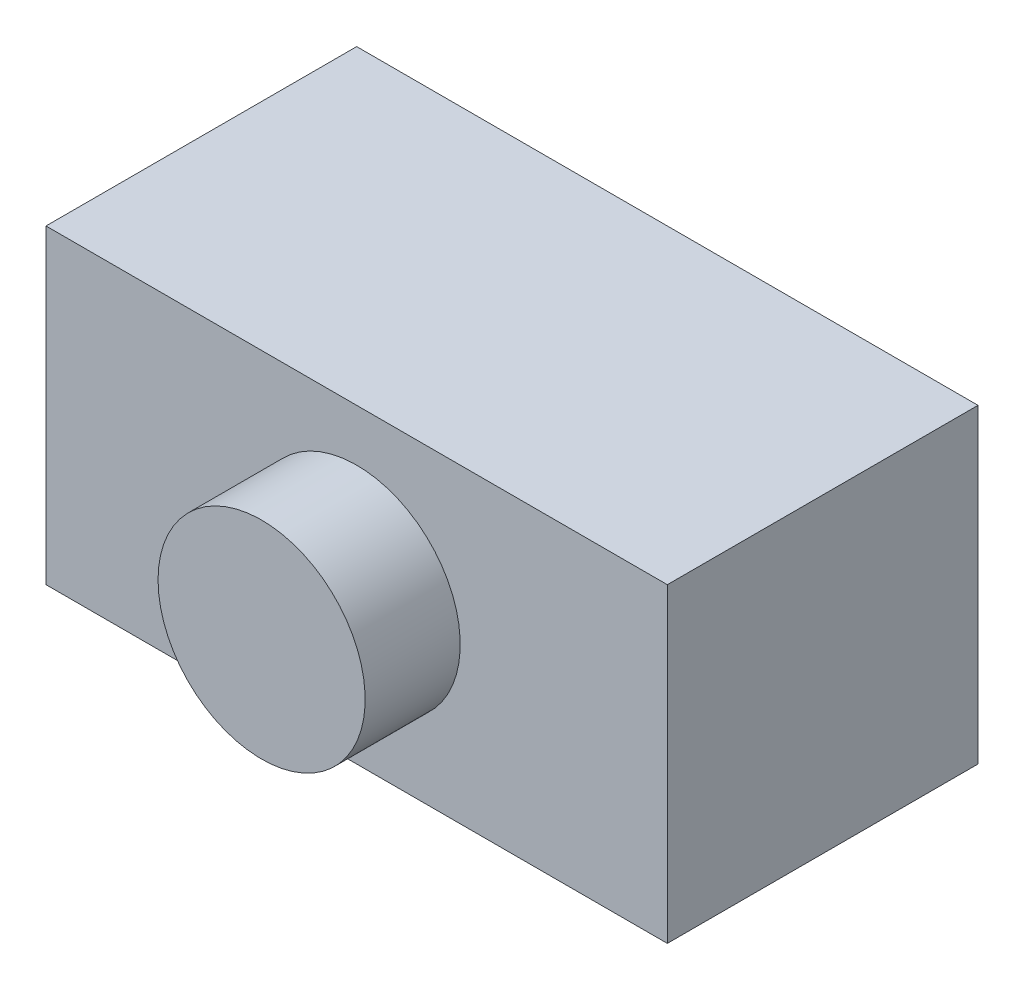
ISO-10303-21;
HEADER;
FILE_DESCRIPTION(('STEP AP214'),'2;1');
FILE_NAME('part.step','',(''),(''),'','','');
FILE_SCHEMA(('AUTOMOTIVE_DESIGN { 1 0 10303 214 1 1 1 1 }'));
ENDSEC;
DATA;
#1=APPLICATION_CONTEXT('core data for automotive mechanical design processes');
#2=APPLICATION_PROTOCOL_DEFINITION('international standard','automotive_design',2000,#1);
#3=PRODUCT_CONTEXT('',#1,'mechanical');
#4=PRODUCT('Part','Part','',(#3));
#5=PRODUCT_RELATED_PRODUCT_CATEGORY('part','',(#4));
#6=PRODUCT_DEFINITION_FORMATION('','',#4);
#7=PRODUCT_DEFINITION_CONTEXT('part definition',#1,'design');
#8=PRODUCT_DEFINITION('design','',#6,#7);
#9=PRODUCT_DEFINITION_SHAPE('','',#8);
#10=(LENGTH_UNIT() NAMED_UNIT(*) SI_UNIT(.MILLI.,.METRE.));
#11=(NAMED_UNIT(*) PLANE_ANGLE_UNIT() SI_UNIT($,.RADIAN.));
#12=(NAMED_UNIT(*) SI_UNIT($,.STERADIAN.) SOLID_ANGLE_UNIT());
#13=UNCERTAINTY_MEASURE_WITH_UNIT(LENGTH_MEASURE(1.E-05),#10,'distance_accuracy_value','');
#14=(GEOMETRIC_REPRESENTATION_CONTEXT(3) GLOBAL_UNCERTAINTY_ASSIGNED_CONTEXT((#13)) GLOBAL_UNIT_ASSIGNED_CONTEXT((#10,
#11,#12)) REPRESENTATION_CONTEXT('',''));
#15=CARTESIAN_POINT('',(0.,0.,0.));
#16=DIRECTION('',(0.,0.,1.));
#17=DIRECTION('',(1.,0.,0.));
#18=AXIS2_PLACEMENT_3D('',#15,#16,#17);
#19=CARTESIAN_POINT('',(0.,0.,5.8293));
#20=DIRECTION('',(0.,0.,-1.));
#21=DIRECTION('',(-1.,0.,0.));
#22=AXIS2_PLACEMENT_3D('',#19,#20,#21);
#23=CYLINDRICAL_SURFACE('',#22,12.7);
#24=CARTESIAN_POINT('',(0.,0.,5.8293));
#25=DIRECTION('',(0.,0.,1.));
#26=DIRECTION('',(1.,0.,0.));
#27=AXIS2_PLACEMENT_3D('',#24,#25,#26);
#28=CIRCLE('',#27,12.7);
#29=CARTESIAN_POINT('',(-12.7,0.,5.8293));
#30=VERTEX_POINT('',#29);
#31=EDGE_CURVE('E11',#30,#30,#28,.T.);
#32=CARTESIAN_POINT('',(0.,0.,-5.8293));
#33=DIRECTION('',(0.,0.,-1.));
#34=DIRECTION('',(-1.,0.,0.));
#35=AXIS2_PLACEMENT_3D('',#32,#33,#34);
#36=CIRCLE('',#35,12.7);
#37=CARTESIAN_POINT('',(-12.7,0.,-5.8293));
#38=VERTEX_POINT('',#37);
#39=EDGE_CURVE('E47',#38,#38,#36,.T.);
#40=CARTESIAN_POINT('',(-12.7,0.,5.8293));
#41=CARTESIAN_POINT('',(-12.7,0.,5.70785625));
#42=CARTESIAN_POINT('',(-12.7,0.,5.5864125));
#43=CARTESIAN_POINT('',(-12.7,0.,5.343525));
#44=CARTESIAN_POINT('',(-12.7,0.,5.22208125));
#45=CARTESIAN_POINT('',(-12.7,0.,4.97919375));
#46=CARTESIAN_POINT('',(-12.7,0.,4.85775));
#47=CARTESIAN_POINT('',(-12.7,0.,4.6148625));
#48=CARTESIAN_POINT('',(-12.7,0.,4.49341875));
#49=CARTESIAN_POINT('',(-12.7,0.,4.25053125));
#50=CARTESIAN_POINT('',(-12.7,0.,4.1290875));
#51=CARTESIAN_POINT('',(-12.7,0.,3.8862));
#52=CARTESIAN_POINT('',(-12.7,0.,3.76475625));
#53=CARTESIAN_POINT('',(-12.7,0.,3.52186875));
#54=CARTESIAN_POINT('',(-12.7,0.,3.400425));
#55=CARTESIAN_POINT('',(-12.7,0.,3.1575375));
#56=CARTESIAN_POINT('',(-12.7,0.,3.03609375));
#57=CARTESIAN_POINT('',(-12.7,0.,2.79320625));
#58=CARTESIAN_POINT('',(-12.7,0.,2.6717625));
#59=CARTESIAN_POINT('',(-12.7,0.,2.428875));
#60=CARTESIAN_POINT('',(-12.7,0.,2.30743125));
#61=CARTESIAN_POINT('',(-12.7,0.,2.06454375));
#62=CARTESIAN_POINT('',(-12.7,0.,1.9431));
#63=CARTESIAN_POINT('',(-12.7,0.,1.7002125));
#64=CARTESIAN_POINT('',(-12.7,0.,1.57876875));
#65=CARTESIAN_POINT('',(-12.7,0.,1.33588125));
#66=CARTESIAN_POINT('',(-12.7,0.,1.2144375));
#67=CARTESIAN_POINT('',(-12.7,0.,0.971549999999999));
#68=CARTESIAN_POINT('',(-12.7,0.,0.850106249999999));
#69=CARTESIAN_POINT('',(-12.7,0.,0.607218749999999));
#70=CARTESIAN_POINT('',(-12.7,0.,0.485774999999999));
#71=CARTESIAN_POINT('',(-12.7,0.,0.242887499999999));
#72=CARTESIAN_POINT('',(-12.7,0.,0.121443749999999));
#73=CARTESIAN_POINT('',(-12.7,0.,-0.121443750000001));
#74=CARTESIAN_POINT('',(-12.7,0.,-0.242887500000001));
#75=CARTESIAN_POINT('',(-12.7,0.,-0.485775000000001));
#76=CARTESIAN_POINT('',(-12.7,0.,-0.607218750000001));
#77=CARTESIAN_POINT('',(-12.7,0.,-0.850106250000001));
#78=CARTESIAN_POINT('',(-12.7,0.,-0.971550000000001));
#79=CARTESIAN_POINT('',(-12.7,0.,-1.2144375));
#80=CARTESIAN_POINT('',(-12.7,0.,-1.33588125));
#81=CARTESIAN_POINT('',(-12.7,0.,-1.57876875));
#82=CARTESIAN_POINT('',(-12.7,0.,-1.7002125));
#83=CARTESIAN_POINT('',(-12.7,0.,-1.9431));
#84=CARTESIAN_POINT('',(-12.7,0.,-2.06454375));
#85=CARTESIAN_POINT('',(-12.7,0.,-2.30743125));
#86=CARTESIAN_POINT('',(-12.7,0.,-2.428875));
#87=CARTESIAN_POINT('',(-12.7,0.,-2.6717625));
#88=CARTESIAN_POINT('',(-12.7,0.,-2.79320625));
#89=CARTESIAN_POINT('',(-12.7,0.,-3.03609375));
#90=CARTESIAN_POINT('',(-12.7,0.,-3.1575375));
#91=CARTESIAN_POINT('',(-12.7,0.,-3.400425));
#92=CARTESIAN_POINT('',(-12.7,0.,-3.52186875));
#93=CARTESIAN_POINT('',(-12.7,0.,-3.76475625));
#94=CARTESIAN_POINT('',(-12.7,0.,-3.8862));
#95=CARTESIAN_POINT('',(-12.7,0.,-4.1290875));
#96=CARTESIAN_POINT('',(-12.7,0.,-4.25053125));
#97=CARTESIAN_POINT('',(-12.7,0.,-4.49341875));
#98=CARTESIAN_POINT('',(-12.7,0.,-4.6148625));
#99=CARTESIAN_POINT('',(-12.7,0.,-4.85775));
#100=CARTESIAN_POINT('',(-12.7,0.,-4.97919375));
#101=CARTESIAN_POINT('',(-12.7,0.,-5.22208125));
#102=CARTESIAN_POINT('',(-12.7,0.,-5.343525));
#103=CARTESIAN_POINT('',(-12.7,0.,-5.5864125));
#104=CARTESIAN_POINT('',(-12.7,0.,-5.70785625));
#105=CARTESIAN_POINT('',(-12.7,0.,-5.8293));
#106=B_SPLINE_CURVE_WITH_KNOTS('',3,(#40,#41,#42,#43,#44,#45,#46,#47,#48,#49,#50,#51,#52,#53,
#54,#55,#56,#57,#58,#59,#60,#61,#62,#63,#64,#65,#66,#67,#68,#69,#70,#71,#72,#73,#74,#75,#76,#77,
#78,#79,#80,#81,#82,#83,#84,#85,#86,#87,#88,#89,#90,#91,#92,#93,#94,#95,#96,#97,#98,#99,#100,
#101,#102,#103,#104,#105),.UNSPECIFIED.,.F.,.F.,(4,2,2,2,2,2,2,2,2,2,2,2,2,2,2,2,2,2,2,2,2,2,2,
2,2,2,2,2,2,2,2,2,4),(0.,0.36433125,0.728662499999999,1.09299375,1.457325,1.82165625,2.1859875,
2.55031875,2.91465,3.27898125,3.6433125,4.00764375,4.371975,4.73630625,5.1006375,5.46496875,
5.8293,6.19363125,6.5579625,6.92229375,7.286625,7.65095625,8.0152875,8.37961875,8.74395,
9.10828125,9.4726125,9.83694375,10.201275,10.56560625,10.9299375,11.29426875,11.6586),.UNSPECIFIED.);
#107=EDGE_CURVE('BSEAM41',#30,#38,#106,.T.);
#108=ORIENTED_EDGE('',*,*,#31,.F.);
#109=ORIENTED_EDGE('',*,*,#39,.F.);
#110=ORIENTED_EDGE('',*,*,#107,.T.);
#111=ORIENTED_EDGE('',*,*,#107,.F.);
#112=EDGE_LOOP('',(#108,#110,#109,#111));
#113=FACE_BOUND('',#112,.T.);
#114=ADVANCED_FACE('F41',(#113),#23,.T.);
#115=CARTESIAN_POINT('',(0.,0.,5.8293));
#116=DIRECTION('',(0.,0.,1.));
#117=DIRECTION('',(1.,0.,0.));
#118=AXIS2_PLACEMENT_3D('',#115,#116,#117);
#119=PLANE('',#118);
#120=ORIENTED_EDGE('',*,*,#31,.T.);
#121=EDGE_LOOP('',(#120));
#122=FACE_BOUND('',#121,.T.);
#123=ADVANCED_FACE('F124',(#122),#119,.T.);
#124=CARTESIAN_POINT('',(-38.1,19.05,-5.8293));
#125=DIRECTION('',(0.,0.,-1.));
#126=DIRECTION('',(-1.,0.,0.));
#127=AXIS2_PLACEMENT_3D('',#124,#125,#126);
#128=PLANE('',#127);
#129=DIRECTION('',(0.,1.,0.));
#130=VECTOR('',#129,1.);
#131=CARTESIAN_POINT('',(-38.1,-19.05,-5.8293));
#132=LINE('',#131,#130);
#133=CARTESIAN_POINT('',(-38.1,-19.05,-5.8293));
#134=VERTEX_POINT('',#133);
#135=CARTESIAN_POINT('',(-38.1,19.05,-5.8293));
#136=VERTEX_POINT('',#135);
#137=EDGE_CURVE('E107',#134,#136,#132,.T.);
#138=ORIENTED_EDGE('',*,*,#137,.F.);
#139=DIRECTION('',(-1.,0.,0.));
#140=VECTOR('',#139,1.);
#141=CARTESIAN_POINT('',(-38.1,-19.05,-5.8293));
#142=LINE('',#141,#140);
#143=CARTESIAN_POINT('',(38.1,-19.05,-5.8293));
#144=VERTEX_POINT('',#143);
#145=EDGE_CURVE('E76',#144,#134,#142,.T.);
#146=ORIENTED_EDGE('',*,*,#145,.F.);
#147=DIRECTION('',(0.,-1.,0.));
#148=VECTOR('',#147,1.);
#149=CARTESIAN_POINT('',(38.1,-19.05,-5.8293));
#150=LINE('',#149,#148);
#151=CARTESIAN_POINT('',(38.1,19.05,-5.8293));
#152=VERTEX_POINT('',#151);
#153=EDGE_CURVE('E74',#152,#144,#150,.T.);
#154=ORIENTED_EDGE('',*,*,#153,.F.);
#155=DIRECTION('',(1.,0.,0.));
#156=VECTOR('',#155,1.);
#157=CARTESIAN_POINT('',(-38.1,19.05,-5.8293));
#158=LINE('',#157,#156);
#159=EDGE_CURVE('E98',#136,#152,#158,.T.);
#160=ORIENTED_EDGE('',*,*,#159,.F.);
#161=EDGE_LOOP('',(#138,#146,#154,#160));
#162=FACE_BOUND('',#161,.T.);
#163=ORIENTED_EDGE('',*,*,#39,.T.);
#164=EDGE_LOOP('',(#163));
#165=FACE_BOUND('',#164,.T.);
#166=ADVANCED_FACE('F118',(#162,#165),#128,.F.);
#167=CARTESIAN_POINT('',(-38.1,-19.05,-43.9293));
#168=DIRECTION('',(1.,0.,0.));
#169=DIRECTION('',(0.,0.,-1.));
#170=AXIS2_PLACEMENT_3D('',#167,#168,#169);
#171=PLANE('',#170);
#172=ORIENTED_EDGE('',*,*,#137,.T.);
#173=DIRECTION('',(0.,0.,1.));
#174=VECTOR('',#173,1.);
#175=CARTESIAN_POINT('',(-38.1,19.05,-43.9293));
#176=LINE('',#175,#174);
#177=CARTESIAN_POINT('',(-38.1,19.05,-43.9293));
#178=VERTEX_POINT('',#177);
#179=EDGE_CURVE('E97',#178,#136,#176,.T.);
#180=ORIENTED_EDGE('',*,*,#179,.F.);
#181=DIRECTION('',(0.,1.,0.));
#182=VECTOR('',#181,1.);
#183=CARTESIAN_POINT('',(-38.1,-19.05,-43.9293));
#184=LINE('',#183,#182);
#185=CARTESIAN_POINT('',(-38.1,-19.05,-43.9293));
#186=VERTEX_POINT('',#185);
#187=EDGE_CURVE('E91',#186,#178,#184,.T.);
#188=ORIENTED_EDGE('',*,*,#187,.F.);
#189=DIRECTION('',(0.,0.,1.));
#190=VECTOR('',#189,1.);
#191=CARTESIAN_POINT('',(-38.1,-19.05,-43.9293));
#192=LINE('',#191,#190);
#193=EDGE_CURVE('E102',#186,#134,#192,.T.);
#194=ORIENTED_EDGE('',*,*,#193,.T.);
#195=EDGE_LOOP('',(#172,#180,#188,#194));
#196=FACE_BOUND('',#195,.T.);
#197=ADVANCED_FACE('F134',(#196),#171,.F.);
#198=CARTESIAN_POINT('',(-38.1,19.05,-43.9293));
#199=DIRECTION('',(0.,-1.,0.));
#200=DIRECTION('',(1.,0.,0.));
#201=AXIS2_PLACEMENT_3D('',#198,#199,#200);
#202=PLANE('',#201);
#203=ORIENTED_EDGE('',*,*,#159,.T.);
#204=DIRECTION('',(0.,0.,1.));
#205=VECTOR('',#204,1.);
#206=CARTESIAN_POINT('',(38.1,19.05,-43.9293));
#207=LINE('',#206,#205);
#208=CARTESIAN_POINT('',(38.1,19.05,-43.9293));
#209=VERTEX_POINT('',#208);
#210=EDGE_CURVE('E96',#209,#152,#207,.T.);
#211=ORIENTED_EDGE('',*,*,#210,.F.);
#212=DIRECTION('',(1.,0.,0.));
#213=VECTOR('',#212,1.);
#214=CARTESIAN_POINT('',(-38.1,19.05,-43.9293));
#215=LINE('',#214,#213);
#216=EDGE_CURVE('E86',#178,#209,#215,.T.);
#217=ORIENTED_EDGE('',*,*,#216,.F.);
#218=ORIENTED_EDGE('',*,*,#179,.T.);
#219=EDGE_LOOP('',(#203,#211,#217,#218));
#220=FACE_BOUND('',#219,.T.);
#221=ADVANCED_FACE('F100',(#220),#202,.F.);
#222=CARTESIAN_POINT('',(38.1,-19.05,-43.9293));
#223=DIRECTION('',(-1.,0.,0.));
#224=DIRECTION('',(0.,0.,1.));
#225=AXIS2_PLACEMENT_3D('',#222,#223,#224);
#226=PLANE('',#225);
#227=ORIENTED_EDGE('',*,*,#153,.T.);
#228=DIRECTION('',(0.,0.,1.));
#229=VECTOR('',#228,1.);
#230=CARTESIAN_POINT('',(38.1,-19.05,-43.9293));
#231=LINE('',#230,#229);
#232=CARTESIAN_POINT('',(38.1,-19.05,-43.9293));
#233=VERTEX_POINT('',#232);
#234=EDGE_CURVE('E99',#233,#144,#231,.T.);
#235=ORIENTED_EDGE('',*,*,#234,.F.);
#236=DIRECTION('',(0.,-1.,0.));
#237=VECTOR('',#236,1.);
#238=CARTESIAN_POINT('',(38.1,-19.05,-43.9293));
#239=LINE('',#238,#237);
#240=EDGE_CURVE('E93',#209,#233,#239,.T.);
#241=ORIENTED_EDGE('',*,*,#240,.F.);
#242=ORIENTED_EDGE('',*,*,#210,.T.);
#243=EDGE_LOOP('',(#227,#235,#241,#242));
#244=FACE_BOUND('',#243,.T.);
#245=ADVANCED_FACE('F105',(#244),#226,.F.);
#246=CARTESIAN_POINT('',(-38.1,-19.05,-43.9293));
#247=DIRECTION('',(0.,1.,0.));
#248=DIRECTION('',(-1.,0.,0.));
#249=AXIS2_PLACEMENT_3D('',#246,#247,#248);
#250=PLANE('',#249);
#251=ORIENTED_EDGE('',*,*,#145,.T.);
#252=ORIENTED_EDGE('',*,*,#193,.F.);
#253=DIRECTION('',(-1.,0.,0.));
#254=VECTOR('',#253,1.);
#255=CARTESIAN_POINT('',(-38.1,-19.05,-43.9293));
#256=LINE('',#255,#254);
#257=EDGE_CURVE('E60',#233,#186,#256,.T.);
#258=ORIENTED_EDGE('',*,*,#257,.F.);
#259=ORIENTED_EDGE('',*,*,#234,.T.);
#260=EDGE_LOOP('',(#251,#252,#258,#259));
#261=FACE_BOUND('',#260,.T.);
#262=ADVANCED_FACE('F141',(#261),#250,.F.);
#263=CARTESIAN_POINT('',(-38.1,19.05,-43.9293));
#264=DIRECTION('',(0.,0.,-1.));
#265=DIRECTION('',(-1.,0.,0.));
#266=AXIS2_PLACEMENT_3D('',#263,#264,#265);
#267=PLANE('',#266);
#268=ORIENTED_EDGE('',*,*,#187,.T.);
#269=ORIENTED_EDGE('',*,*,#216,.T.);
#270=ORIENTED_EDGE('',*,*,#240,.T.);
#271=ORIENTED_EDGE('',*,*,#257,.T.);
#272=EDGE_LOOP('',(#268,#269,#270,#271));
#273=FACE_BOUND('',#272,.T.);
#274=ADVANCED_FACE('F90',(#273),#267,.T.);
#275=CLOSED_SHELL('',(#114,#123,#166,#197,#221,#245,#262,#274));
#276=MANIFOLD_SOLID_BREP('B2',#275);
#277=ADVANCED_BREP_SHAPE_REPRESENTATION('',(#18,#276),#14);
#278=SHAPE_DEFINITION_REPRESENTATION(#9,#277);
ENDSEC;
END-ISO-10303-21;
